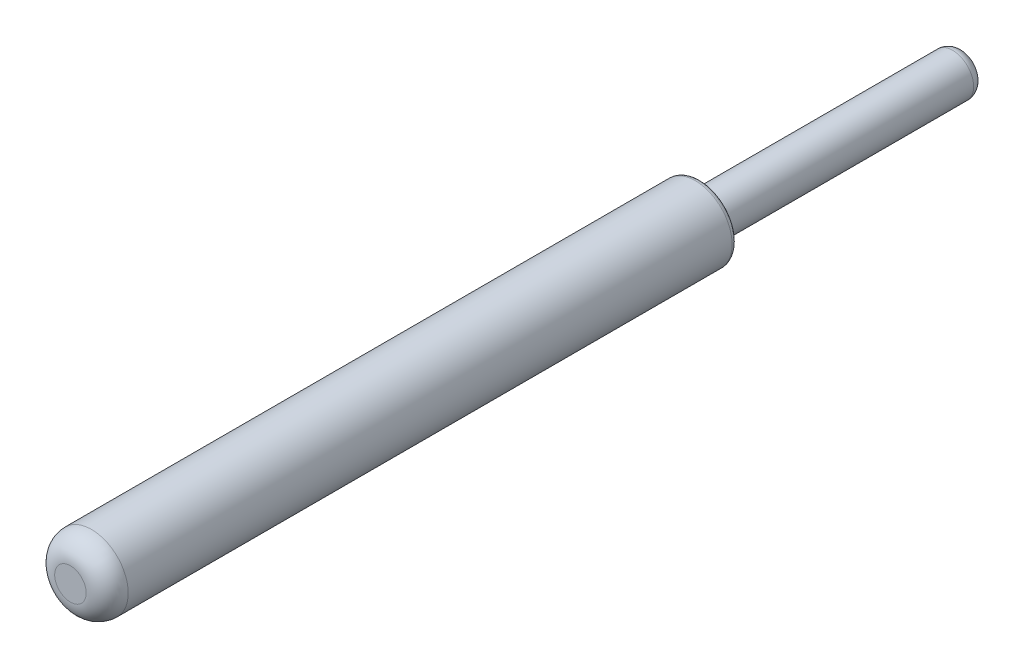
ISO-10303-21;
HEADER;
FILE_DESCRIPTION(('STEP AP214'),'2;1');
FILE_NAME('part.step','',(''),(''),'','','');
FILE_SCHEMA(('AUTOMOTIVE_DESIGN { 1 0 10303 214 1 1 1 1 }'));
ENDSEC;
DATA;
#1=APPLICATION_CONTEXT('core data for automotive mechanical design processes');
#2=APPLICATION_PROTOCOL_DEFINITION('international standard','automotive_design',2000,#1);
#3=PRODUCT_CONTEXT('',#1,'mechanical');
#4=PRODUCT('Part','Part','',(#3));
#5=PRODUCT_RELATED_PRODUCT_CATEGORY('part','',(#4));
#6=PRODUCT_DEFINITION_FORMATION('','',#4);
#7=PRODUCT_DEFINITION_CONTEXT('part definition',#1,'design');
#8=PRODUCT_DEFINITION('design','',#6,#7);
#9=PRODUCT_DEFINITION_SHAPE('','',#8);
#10=(LENGTH_UNIT() NAMED_UNIT(*) SI_UNIT(.MILLI.,.METRE.));
#11=(NAMED_UNIT(*) PLANE_ANGLE_UNIT() SI_UNIT($,.RADIAN.));
#12=(NAMED_UNIT(*) SI_UNIT($,.STERADIAN.) SOLID_ANGLE_UNIT());
#13=UNCERTAINTY_MEASURE_WITH_UNIT(LENGTH_MEASURE(1.E-05),#10,'distance_accuracy_value','');
#14=(GEOMETRIC_REPRESENTATION_CONTEXT(3) GLOBAL_UNCERTAINTY_ASSIGNED_CONTEXT((#13)) GLOBAL_UNIT_ASSIGNED_CONTEXT((#10,
#11,#12)) REPRESENTATION_CONTEXT('',''));
#15=CARTESIAN_POINT('',(0.,0.,0.));
#16=DIRECTION('',(0.,0.,1.));
#17=DIRECTION('',(1.,0.,0.));
#18=AXIS2_PLACEMENT_3D('',#15,#16,#17);
#19=CARTESIAN_POINT('',(0.,0.,25.));
#20=DIRECTION('',(0.,0.,-1.));
#21=DIRECTION('',(-1.,0.,0.));
#22=AXIS2_PLACEMENT_3D('',#19,#20,#21);
#23=CYLINDRICAL_SURFACE('',#22,2.);
#24=CARTESIAN_POINT('',(0.,0.,1.));
#25=DIRECTION('',(0.,0.,1.));
#26=DIRECTION('',(1.,0.,0.));
#27=AXIS2_PLACEMENT_3D('',#24,#25,#26);
#28=CIRCLE('',#27,2.);
#29=CARTESIAN_POINT('',(2.,0.,1.));
#30=VERTEX_POINT('',#29);
#31=EDGE_CURVE('E50',#30,#30,#28,.T.);
#32=ORIENTED_EDGE('',*,*,#31,.T.);
#33=EDGE_LOOP('',(#32));
#34=FACE_BOUND('',#33,.T.);
#35=CARTESIAN_POINT('',(0.,0.,25.));
#36=DIRECTION('',(0.,0.,1.));
#37=DIRECTION('',(1.,0.,0.));
#38=AXIS2_PLACEMENT_3D('',#35,#36,#37);
#39=CIRCLE('',#38,2.);
#40=CARTESIAN_POINT('',(2.,0.,25.));
#41=VERTEX_POINT('',#40);
#42=EDGE_CURVE('E61',#41,#41,#39,.T.);
#43=ORIENTED_EDGE('',*,*,#42,.F.);
#44=EDGE_LOOP('',(#43));
#45=FACE_BOUND('',#44,.T.);
#46=ADVANCED_FACE('F35',(#34,#45),#23,.T.);
#47=CARTESIAN_POINT('',(0.,0.,0.));
#48=DIRECTION('',(0.,0.,1.));
#49=DIRECTION('',(1.,0.,0.));
#50=AXIS2_PLACEMENT_3D('',#47,#48,#49);
#51=PLANE('',#50);
#52=CARTESIAN_POINT('',(0.,0.,0.));
#53=DIRECTION('',(0.,0.,1.));
#54=DIRECTION('',(1.,0.,0.));
#55=AXIS2_PLACEMENT_3D('',#52,#53,#54);
#56=CIRCLE('',#55,1.);
#57=CARTESIAN_POINT('',(1.,0.,0.));
#58=VERTEX_POINT('',#57);
#59=EDGE_CURVE('E46',#58,#58,#56,.F.);
#60=ORIENTED_EDGE('',*,*,#59,.T.);
#61=EDGE_LOOP('',(#60));
#62=FACE_BOUND('',#61,.T.);
#63=ADVANCED_FACE('F68',(#62),#51,.F.);
#64=CARTESIAN_POINT('',(0.,0.,85.));
#65=DIRECTION('',(0.,0.,-1.));
#66=DIRECTION('',(-1.,0.,0.));
#67=AXIS2_PLACEMENT_3D('',#64,#65,#66);
#68=CYLINDRICAL_SURFACE('',#67,3.5);
#69=CARTESIAN_POINT('',(0.,0.,25.5));
#70=DIRECTION('',(0.,0.,1.));
#71=DIRECTION('',(1.,0.,0.));
#72=AXIS2_PLACEMENT_3D('',#69,#70,#71);
#73=CIRCLE('',#72,3.5);
#74=CARTESIAN_POINT('',(3.5,0.,25.5));
#75=VERTEX_POINT('',#74);
#76=EDGE_CURVE('E42',#75,#75,#73,.T.);
#77=ORIENTED_EDGE('',*,*,#76,.T.);
#78=EDGE_LOOP('',(#77));
#79=FACE_BOUND('',#78,.T.);
#80=CARTESIAN_POINT('',(0.,0.,83.));
#81=DIRECTION('',(0.,0.,1.));
#82=DIRECTION('',(1.,0.,0.));
#83=AXIS2_PLACEMENT_3D('',#80,#81,#82);
#84=CIRCLE('',#83,3.5);
#85=CARTESIAN_POINT('',(3.5,0.,83.));
#86=VERTEX_POINT('',#85);
#87=EDGE_CURVE('E55',#86,#86,#84,.F.);
#88=ORIENTED_EDGE('',*,*,#87,.T.);
#89=EDGE_LOOP('',(#88));
#90=FACE_BOUND('',#89,.T.);
#91=ADVANCED_FACE('F74',(#79,#90),#68,.T.);
#92=CARTESIAN_POINT('',(0.,0.,85.));
#93=DIRECTION('',(0.,0.,1.));
#94=DIRECTION('',(1.,0.,0.));
#95=AXIS2_PLACEMENT_3D('',#92,#93,#94);
#96=PLANE('',#95);
#97=CARTESIAN_POINT('',(0.,0.,85.));
#98=DIRECTION('',(0.,0.,1.));
#99=DIRECTION('',(1.,0.,0.));
#100=AXIS2_PLACEMENT_3D('',#97,#98,#99);
#101=CIRCLE('',#100,1.5);
#102=CARTESIAN_POINT('',(1.5,0.,85.));
#103=VERTEX_POINT('',#102);
#104=EDGE_CURVE('E58',#103,#103,#101,.T.);
#105=ORIENTED_EDGE('',*,*,#104,.T.);
#106=EDGE_LOOP('',(#105));
#107=FACE_BOUND('',#106,.T.);
#108=ADVANCED_FACE('F105',(#107),#96,.T.);
#109=CARTESIAN_POINT('',(0.,0.,25.));
#110=DIRECTION('',(0.,0.,1.));
#111=DIRECTION('',(1.,0.,0.));
#112=AXIS2_PLACEMENT_3D('',#109,#110,#111);
#113=PLANE('',#112);
#114=CARTESIAN_POINT('',(0.,0.,25.));
#115=DIRECTION('',(0.,0.,1.));
#116=DIRECTION('',(1.,0.,0.));
#117=AXIS2_PLACEMENT_3D('',#114,#115,#116);
#118=CIRCLE('',#117,3.);
#119=CARTESIAN_POINT('',(3.,0.,25.));
#120=VERTEX_POINT('',#119);
#121=EDGE_CURVE('E10',#120,#120,#118,.F.);
#122=ORIENTED_EDGE('',*,*,#121,.T.);
#123=EDGE_LOOP('',(#122));
#124=FACE_BOUND('',#123,.T.);
#125=ORIENTED_EDGE('',*,*,#42,.T.);
#126=EDGE_LOOP('',(#125));
#127=FACE_BOUND('',#126,.T.);
#128=ADVANCED_FACE('F65',(#124,#127),#113,.F.);
#129=CARTESIAN_POINT('',(0.,0.,83.));
#130=DIRECTION('',(0.,0.,1.));
#131=DIRECTION('',(1.,0.,0.));
#132=AXIS2_PLACEMENT_3D('',#129,#130,#131);
#133=DEGENERATE_TOROIDAL_SURFACE('',#132,1.5,2.,.T.);
#134=ORIENTED_EDGE('',*,*,#87,.F.);
#135=EDGE_LOOP('',(#134));
#136=FACE_BOUND('',#135,.T.);
#137=ORIENTED_EDGE('',*,*,#104,.F.);
#138=EDGE_LOOP('',(#137));
#139=FACE_BOUND('',#138,.T.);
#140=ADVANCED_FACE('F79',(#136,#139),#133,.T.);
#141=CARTESIAN_POINT('',(0.,0.,1.));
#142=DIRECTION('',(0.,0.,1.));
#143=DIRECTION('',(1.,0.,0.));
#144=AXIS2_PLACEMENT_3D('',#141,#142,#143);
#145=DEGENERATE_TOROIDAL_SURFACE('',#144,1.,1.,.T.);
#146=ORIENTED_EDGE('',*,*,#59,.F.);
#147=EDGE_LOOP('',(#146));
#148=FACE_BOUND('',#147,.T.);
#149=ORIENTED_EDGE('',*,*,#31,.F.);
#150=EDGE_LOOP('',(#149));
#151=FACE_BOUND('',#150,.T.);
#152=ADVANCED_FACE('F81',(#148,#151),#145,.T.);
#153=CARTESIAN_POINT('',(0.,0.,25.5));
#154=DIRECTION('',(0.,0.,1.));
#155=DIRECTION('',(1.,0.,0.));
#156=AXIS2_PLACEMENT_3D('',#153,#154,#155);
#157=TOROIDAL_SURFACE('',#156,3.,0.5);
#158=ORIENTED_EDGE('',*,*,#121,.F.);
#159=EDGE_LOOP('',(#158));
#160=FACE_BOUND('',#159,.T.);
#161=ORIENTED_EDGE('',*,*,#76,.F.);
#162=EDGE_LOOP('',(#161));
#163=FACE_BOUND('',#162,.T.);
#164=ADVANCED_FACE('F37',(#160,#163),#157,.T.);
#165=CLOSED_SHELL('',(#46,#63,#91,#108,#128,#140,#152,#164));
#166=MANIFOLD_SOLID_BREP('B2',#165);
#167=ADVANCED_BREP_SHAPE_REPRESENTATION('',(#18,#166),#14);
#168=SHAPE_DEFINITION_REPRESENTATION(#9,#167);
ENDSEC;
END-ISO-10303-21;
